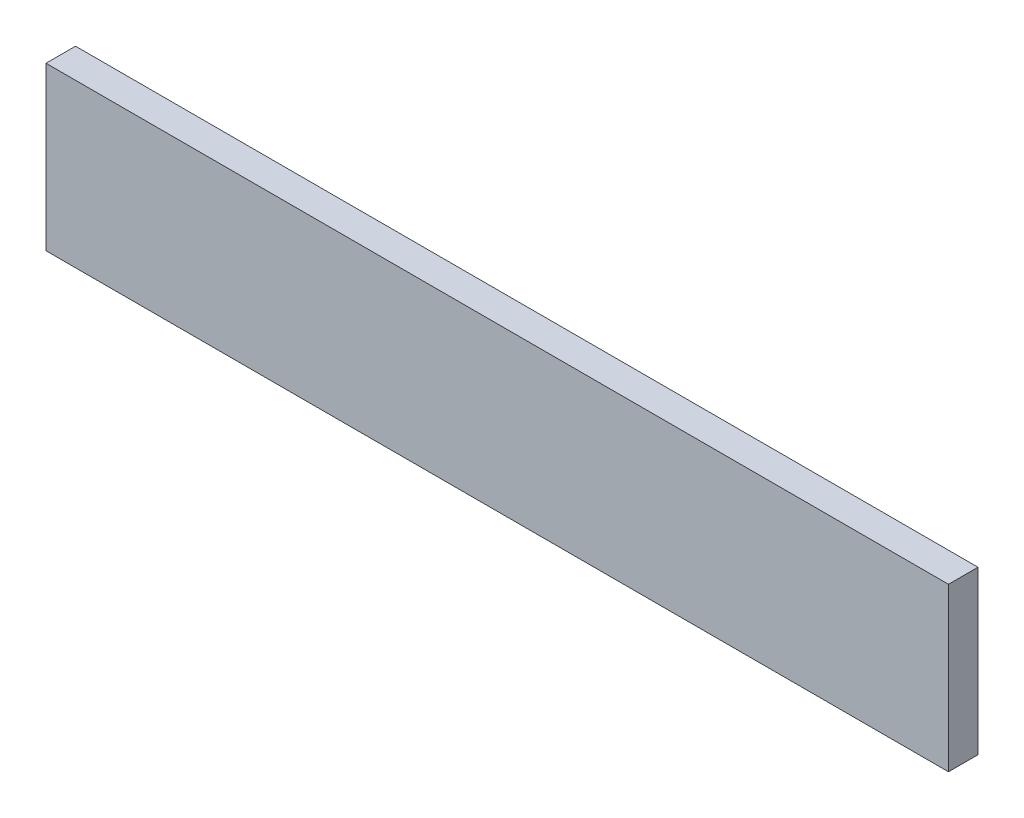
ISO-10303-21;
HEADER;
FILE_DESCRIPTION(('STEP AP214'),'2;1');
FILE_NAME('part.step','',(''),(''),'','','');
FILE_SCHEMA(('AUTOMOTIVE_DESIGN { 1 0 10303 214 1 1 1 1 }'));
ENDSEC;
DATA;
#1=APPLICATION_CONTEXT('core data for automotive mechanical design processes');
#2=APPLICATION_PROTOCOL_DEFINITION('international standard','automotive_design',2000,#1);
#3=PRODUCT_CONTEXT('',#1,'mechanical');
#4=PRODUCT('Part','Part','',(#3));
#5=PRODUCT_RELATED_PRODUCT_CATEGORY('part','',(#4));
#6=PRODUCT_DEFINITION_FORMATION('','',#4);
#7=PRODUCT_DEFINITION_CONTEXT('part definition',#1,'design');
#8=PRODUCT_DEFINITION('design','',#6,#7);
#9=PRODUCT_DEFINITION_SHAPE('','',#8);
#10=(LENGTH_UNIT() NAMED_UNIT(*) SI_UNIT(.MILLI.,.METRE.));
#11=(NAMED_UNIT(*) PLANE_ANGLE_UNIT() SI_UNIT($,.RADIAN.));
#12=(NAMED_UNIT(*) SI_UNIT($,.STERADIAN.) SOLID_ANGLE_UNIT());
#13=UNCERTAINTY_MEASURE_WITH_UNIT(LENGTH_MEASURE(1.E-05),#10,'distance_accuracy_value','');
#14=(GEOMETRIC_REPRESENTATION_CONTEXT(3) GLOBAL_UNCERTAINTY_ASSIGNED_CONTEXT((#13)) GLOBAL_UNIT_ASSIGNED_CONTEXT((#10,
#11,#12)) REPRESENTATION_CONTEXT('',''));
#15=CARTESIAN_POINT('',(0.,0.,0.));
#16=DIRECTION('',(0.,0.,1.));
#17=DIRECTION('',(1.,0.,0.));
#18=AXIS2_PLACEMENT_3D('',#15,#16,#17);
#19=CARTESIAN_POINT('',(305.623480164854,0.,-9.99999999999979));
#20=DIRECTION('',(1.,0.,0.));
#21=DIRECTION('',(0.,1.,0.));
#22=AXIS2_PLACEMENT_3D('',#19,#20,#21);
#23=PLANE('',#22);
#24=DIRECTION('',(0.,1.,0.));
#25=VECTOR('',#24,1.);
#26=CARTESIAN_POINT('',(305.623480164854,0.,0.));
#27=LINE('',#26,#25);
#28=CARTESIAN_POINT('',(305.623480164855,-55.0000000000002,-8.88178419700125E-13));
#29=VERTEX_POINT('',#28);
#30=CARTESIAN_POINT('',(305.623480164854,0.,0.));
#31=VERTEX_POINT('',#30);
#32=EDGE_CURVE('E73',#29,#31,#27,.T.);
#33=ORIENTED_EDGE('',*,*,#32,.F.);
#34=DIRECTION('',(0.,0.,1.));
#35=VECTOR('',#34,1.);
#36=CARTESIAN_POINT('',(305.623480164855,-55.0000000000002,-10.0000000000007));
#37=LINE('',#36,#35);
#38=CARTESIAN_POINT('',(305.623480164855,-55.0000000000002,-10.0000000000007));
#39=VERTEX_POINT('',#38);
#40=EDGE_CURVE('E11',#39,#29,#37,.T.);
#41=ORIENTED_EDGE('',*,*,#40,.F.);
#42=DIRECTION('',(0.,1.,0.));
#43=VECTOR('',#42,1.);
#44=CARTESIAN_POINT('',(305.623480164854,0.,-9.99999999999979));
#45=LINE('',#44,#43);
#46=CARTESIAN_POINT('',(305.623480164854,0.,-9.99999999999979));
#47=VERTEX_POINT('',#46);
#48=EDGE_CURVE('E75',#39,#47,#45,.T.);
#49=ORIENTED_EDGE('',*,*,#48,.T.);
#50=DIRECTION('',(0.,0.,1.));
#51=VECTOR('',#50,1.);
#52=CARTESIAN_POINT('',(305.623480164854,0.,-9.99999999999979));
#53=LINE('',#52,#51);
#54=EDGE_CURVE('E36',#47,#31,#53,.T.);
#55=ORIENTED_EDGE('',*,*,#54,.T.);
#56=EDGE_LOOP('',(#33,#41,#49,#55));
#57=FACE_BOUND('',#56,.T.);
#58=ADVANCED_FACE('F33',(#57),#23,.T.);
#59=CARTESIAN_POINT('',(305.623480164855,-55.0000000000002,-10.0000000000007));
#60=DIRECTION('',(0.,-1.,0.));
#61=DIRECTION('',(0.,0.,-1.));
#62=AXIS2_PLACEMENT_3D('',#59,#60,#61);
#63=PLANE('',#62);
#64=DIRECTION('',(1.,0.,0.));
#65=VECTOR('',#64,1.);
#66=CARTESIAN_POINT('',(305.623480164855,-55.0000000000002,-8.88178419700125E-13));
#67=LINE('',#66,#65);
#68=CARTESIAN_POINT('',(0.,-55.0000000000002,0.));
#69=VERTEX_POINT('',#68);
#70=EDGE_CURVE('E90',#69,#29,#67,.T.);
#71=ORIENTED_EDGE('',*,*,#70,.F.);
#72=DIRECTION('',(0.,0.,1.));
#73=VECTOR('',#72,1.);
#74=CARTESIAN_POINT('',(0.,-55.0000000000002,-9.99999999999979));
#75=LINE('',#74,#73);
#76=CARTESIAN_POINT('',(0.,-55.0000000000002,-9.99999999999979));
#77=VERTEX_POINT('',#76);
#78=EDGE_CURVE('E41',#77,#69,#75,.T.);
#79=ORIENTED_EDGE('',*,*,#78,.F.);
#80=DIRECTION('',(1.,0.,0.));
#81=VECTOR('',#80,1.);
#82=CARTESIAN_POINT('',(305.623480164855,-55.0000000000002,-10.0000000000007));
#83=LINE('',#82,#81);
#84=EDGE_CURVE('E80',#77,#39,#83,.T.);
#85=ORIENTED_EDGE('',*,*,#84,.T.);
#86=ORIENTED_EDGE('',*,*,#40,.T.);
#87=EDGE_LOOP('',(#71,#79,#85,#86));
#88=FACE_BOUND('',#87,.T.);
#89=ADVANCED_FACE('F105',(#88),#63,.T.);
#90=CARTESIAN_POINT('',(0.,0.,-9.99999999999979));
#91=DIRECTION('',(-1.,0.,0.));
#92=DIRECTION('',(0.,-1.,0.));
#93=AXIS2_PLACEMENT_3D('',#90,#91,#92);
#94=PLANE('',#93);
#95=DIRECTION('',(0.,-1.,0.));
#96=VECTOR('',#95,1.);
#97=CARTESIAN_POINT('',(0.,0.,0.));
#98=LINE('',#97,#96);
#99=CARTESIAN_POINT('',(0.,0.,0.));
#100=VERTEX_POINT('',#99);
#101=EDGE_CURVE('E87',#100,#69,#98,.T.);
#102=ORIENTED_EDGE('',*,*,#101,.F.);
#103=DIRECTION('',(0.,0.,1.));
#104=VECTOR('',#103,1.);
#105=CARTESIAN_POINT('',(0.,0.,-9.99999999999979));
#106=LINE('',#105,#104);
#107=CARTESIAN_POINT('',(0.,0.,-9.99999999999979));
#108=VERTEX_POINT('',#107);
#109=EDGE_CURVE('E79',#108,#100,#106,.T.);
#110=ORIENTED_EDGE('',*,*,#109,.F.);
#111=DIRECTION('',(0.,-1.,0.));
#112=VECTOR('',#111,1.);
#113=CARTESIAN_POINT('',(0.,0.,-9.99999999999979));
#114=LINE('',#113,#112);
#115=EDGE_CURVE('E98',#108,#77,#114,.T.);
#116=ORIENTED_EDGE('',*,*,#115,.T.);
#117=ORIENTED_EDGE('',*,*,#78,.T.);
#118=EDGE_LOOP('',(#102,#110,#116,#117));
#119=FACE_BOUND('',#118,.T.);
#120=ADVANCED_FACE('F102',(#119),#94,.T.);
#121=CARTESIAN_POINT('',(305.623480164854,0.,-9.99999999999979));
#122=DIRECTION('',(0.,1.,0.));
#123=DIRECTION('',(0.,0.,1.));
#124=AXIS2_PLACEMENT_3D('',#121,#122,#123);
#125=PLANE('',#124);
#126=DIRECTION('',(-1.,0.,0.));
#127=VECTOR('',#126,1.);
#128=CARTESIAN_POINT('',(305.623480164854,0.,0.));
#129=LINE('',#128,#127);
#130=EDGE_CURVE('E82',#31,#100,#129,.T.);
#131=ORIENTED_EDGE('',*,*,#130,.F.);
#132=ORIENTED_EDGE('',*,*,#54,.F.);
#133=DIRECTION('',(-1.,0.,0.));
#134=VECTOR('',#133,1.);
#135=CARTESIAN_POINT('',(305.623480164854,0.,-9.99999999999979));
#136=LINE('',#135,#134);
#137=EDGE_CURVE('E96',#47,#108,#136,.T.);
#138=ORIENTED_EDGE('',*,*,#137,.T.);
#139=ORIENTED_EDGE('',*,*,#109,.T.);
#140=EDGE_LOOP('',(#131,#132,#138,#139));
#141=FACE_BOUND('',#140,.T.);
#142=ADVANCED_FACE('F83',(#141),#125,.T.);
#143=CARTESIAN_POINT('',(305.623480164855,-55.0000000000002,-10.0000000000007));
#144=DIRECTION('',(0.,0.,-1.));
#145=DIRECTION('',(-1.,0.,0.));
#146=AXIS2_PLACEMENT_3D('',#143,#144,#145);
#147=PLANE('',#146);
#148=ORIENTED_EDGE('',*,*,#48,.F.);
#149=ORIENTED_EDGE('',*,*,#84,.F.);
#150=ORIENTED_EDGE('',*,*,#115,.F.);
#151=ORIENTED_EDGE('',*,*,#137,.F.);
#152=EDGE_LOOP('',(#148,#149,#150,#151));
#153=FACE_BOUND('',#152,.T.);
#154=ADVANCED_FACE('F107',(#153),#147,.T.);
#155=CARTESIAN_POINT('',(305.623480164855,-55.0000000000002,-8.88178419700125E-13));
#156=DIRECTION('',(0.,0.,-1.));
#157=DIRECTION('',(-1.,0.,0.));
#158=AXIS2_PLACEMENT_3D('',#155,#156,#157);
#159=PLANE('',#158);
#160=ORIENTED_EDGE('',*,*,#32,.T.);
#161=ORIENTED_EDGE('',*,*,#130,.T.);
#162=ORIENTED_EDGE('',*,*,#101,.T.);
#163=ORIENTED_EDGE('',*,*,#70,.T.);
#164=EDGE_LOOP('',(#160,#161,#162,#163));
#165=FACE_BOUND('',#164,.T.);
#166=ADVANCED_FACE('F89',(#165),#159,.F.);
#167=CLOSED_SHELL('',(#58,#89,#120,#142,#154,#166));
#168=MANIFOLD_SOLID_BREP('B2',#167);
#169=ADVANCED_BREP_SHAPE_REPRESENTATION('',(#18,#168),#14);
#170=SHAPE_DEFINITION_REPRESENTATION(#9,#169);
ENDSEC;
END-ISO-10303-21;
